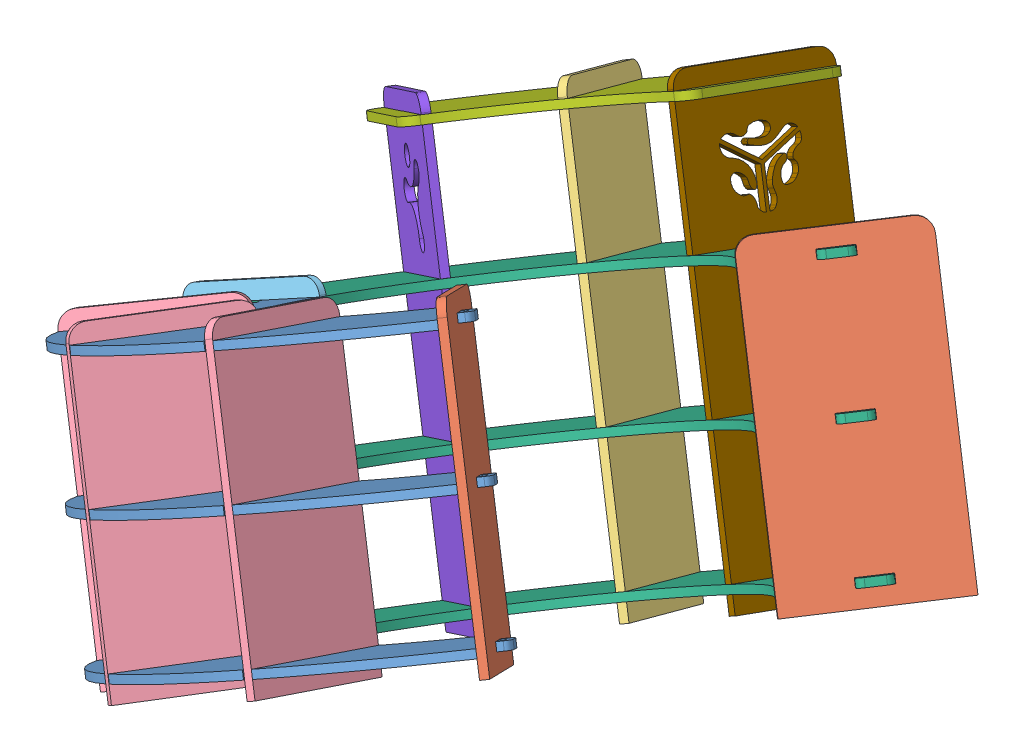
SolidWorks assembly Ensamblaje1Render.SLDASM, configuration Predeterminado (file format 10000). Lengths in mm.
Overall size (1967.4 1965.3 2323.95).
16 component instances, 9 part files, 47 mates.
Components (placement in the parent):
- 01 BaseParte2-1: 01 BaseParte2.SLDPRT [Predeterminado] at (-95.5965 5515.7388 -524.2059) x (0.888603 0.453154 -0.070968) z (-0.070968 0.288691 0.954789) size (1642.72 23 1000)
- 02 ExtremoAlto2-1: 02 ExtremoAlto2.SLDPRT [Predeterminado] at (483.5622 5313.2287 -1465.3669) x (-0.625547 -0.070132 0.777028) z (-0.635092 -0.532703 -0.559362) size (450 860 23)
- 01 BaseParte2-2: 01 BaseParte2.SLDPRT [Predeterminado] at (239.7374 4891.6292 -310.5747) x (0.888603 0.453154 -0.070968) z (-0.070968 0.288691 0.954789) size (1642.72 23 1000)
- 01 BaseParte2-3: 01 BaseParte2.SLDPRT [Predeterminado] at (72.0704 5203.684 -417.3903) x (0.888603 0.453154 -0.070968) z (-0.070968 0.288691 0.954789) size (1642.72 23 1000)
- 02 ExtremoAlto2-2: 02 ExtremoAlto2.SLDPRT [Predeterminado] at (384.6448 5643.9436 -343.9355) x (-0.516818 -0.512432 -0.685793) z (0.726327 0.161569 -0.668091) size (450 860 23)
- 03 ParedAlta-3: 03 ParedAlta.SLDPRT [Predeterminado] at (-211.6851 4656.7022 -1612.459) x (0.311221 0.453154 0.83534) z (0.453154 -0.843391 0.288691) size (450 23 1230)
- 03ParedBajaUnion-1: 03ParedBajaUnion.SLDPRT [Predeterminado] at (-369.3385 5296.5662 -185.0663) x (0.439858 -0.070132 -0.895325) z (0.775355 0.532703 0.339192) size (450 860 23)
- 03ParedBaja-3: 03ParedBaja.SLDPRT [Predeterminado] at (-716.6208 4911.2914 -834.7756) x (0.888603 0.453154 -0.070968) z (-0.070968 0.288691 0.954789) size (450 860 20)
- 03ParedBajaUnion-2: 03ParedBajaUnion.SLDPRT [Predeterminado] at (9.1704 5513.2982 -146.0381) x (-0.045625 -0.34537 -0.937357) z (0.890264 0.411595 -0.194986) size (450 860 23)
- 01 BaseParte1-4: 01 BaseParte1.SLDPRT [Predeterminado] at (296.3359 4646.6186 -1115.1989) x (0.888603 0.453154 -0.070968) z (-0.070968 0.288691 0.954789) size (1642.73 23 1060)
- 01 BaseParte1-5: 01 BaseParte1.SLDPRT [Predeterminado] at (128.669 4958.6734 -1222.0145) x (0.888603 0.453154 -0.070968) z (-0.070968 0.288691 0.954789) size (1642.73 23 1060)
- 01 BaseParte1-6: 01 BaseParte1.SLDPRT [Predeterminado] at (-38.998 5270.7283 -1328.8301) x (0.888603 0.453154 -0.070968) z (-0.070968 0.288691 0.954789) size (1642.73 23 1060)
- 01 BaseParte3-4: 01 BaseParte3.SLDPRT [Predeterminado] at (-207.9131 5582.3571 -1434.9311) x (0.888603 0.453154 -0.070968) z (-0.070968 0.288691 0.954789) size (1042.91 23 738.06)
- 03 ParedAlta logotipo-1: 03 ParedAlta logotipo.SLDPRT [Predeterminado] at (-593.0678 4573.6911 -1256.3197) x (0.711309 0.5373 0.453154) z (0.453154 -0.843391 0.288691) size (450 23 1230)
- 03 ParedAlta logotipo2-1: 03 ParedAlta logotipo2.SLDPRT [Predeterminado] at (258.228 4872.217 -1720.4626) x (-0.186347 0.227073 0.955883) z (0.453154 -0.843391 0.288691) size (450 23 1230)
- 03ParedBajaUnion-4: 03ParedBajaUnion.SLDPRT [Predeterminado] at (-634.7154 5066.9131 -439.4247) x (0.78783 0.227374 -0.572386) z (0.417104 0.486818 0.767484) size (450 860 23)
Mates (geometry in assembly coordinates):
- Coincidente28: coincident anti-aligned: plane of 01 BaseParte2-1 through (74.9008 5575.3819 -697.2598) normal (0.726327 0.161569 -0.668091); plane of 02 ExtremoAlto2-2 through (384.6448 5643.9436 -343.9355) normal (-0.726327 -0.161569 0.668091)
- Coincidente30: coincident anti-aligned: plane of 01 BaseParte2-1 through (96.6279 5736.0637 -261.9431) normal (-0.516818 -0.512432 -0.685793); plane of 02 ExtremoAlto2-2 through (377.8777 5624.3865 -390.4485) normal (0.516818 0.512432 0.685793)
- Coincidente49: coincident anti-aligned: plane of 01 BaseParte2-3 through (87.1221 5119.4552 -766.7554) normal (0.070968 -0.288691 -0.954789); plane of 01 BaseParte1-5 through (83.8951 5117.8096 -766.4977) normal (-0.070968 0.288691 0.954789)
- Coincidente50: coincident aligned: plane of 01 BaseParte2-3 through (61.6479 5223.082 -424.0302) normal (-0.453154 0.843391 -0.288691); plane of 01 BaseParte1-5 through (118.2464 4978.0714 -1228.6544) normal (-0.453154 0.843391 -0.288691)
- Coincidente51: coincident anti-aligned: plane of 01 BaseParte2-3 through (-686.0064 4841.8066 -364.3192) normal (0.888603 0.453154 -0.070968); plane of 01 BaseParte1-5 through (-626.1809 4598.4416 -1169.2011) normal (-0.888603 -0.453154 0.070968)
- Coincidente52: coincident aligned: plane of 01 BaseParte2-2 through (229.3148 4911.0272 -317.2146) normal (-0.453154 0.843391 -0.288691); plane of 01 BaseParte1-4 through (285.9134 4666.0166 -1121.8388) normal (-0.453154 0.843391 -0.288691)
- Coincidente53: coincident anti-aligned: plane of 01 BaseParte2-2 through (254.789 4807.4004 -659.9398) normal (0.070968 -0.288691 -0.954789); plane of 01 BaseParte1-4 through (251.5621 4805.7548 -659.6821) normal (-0.070968 0.288691 0.954789)
- Coincidente54: coincident anti-aligned: plane of 01 BaseParte2-2 through (-447.2512 4566.0041 -263.181) normal (-0.888603 -0.453154 0.070968); plane of 01 BaseParte1-4 through (-387.4257 4322.6391 -1068.0629) normal (0.888603 0.453154 -0.070968)
- Coincidente55: coincident aligned: plane of 01 BaseParte2-1 through (-106.0191 5535.1368 -530.8458) normal (-0.453154 0.843391 -0.288691); plane of 01 BaseParte1-6 through (-49.4205 5290.1263 -1335.47) normal (-0.453154 0.843391 -0.288691)
- Coincidente56: coincident anti-aligned: plane of 01 BaseParte2-1 through (-80.5449 5431.5101 -873.5711) normal (0.070968 -0.288691 -0.954789); plane of 01 BaseParte1-6 through (-83.7718 5429.8644 -873.3133) normal (-0.070968 0.288691 0.954789)
- Coincidente57: coincident anti-aligned: plane of 01 BaseParte2-1 through (-782.5851 5190.1137 -476.8122) normal (-0.888603 -0.453154 0.070968); plane of 01 BaseParte1-6 through (-722.7596 4946.7488 -1281.6941) normal (0.888603 0.453154 -0.070968)
- Coincidente60: coincident anti-aligned: plane of 03ParedBaja-3 through (-814.3702 5016.9795 -853.05) normal (0.888603 0.453154 -0.070968); plane of 01 BaseParte1-6 through (-793.8478 4910.4965 -1276.0167) normal (-0.888603 -0.453154 0.070968)
- Coincidente61: coincident anti-aligned: plane of 01 BaseParte2-2 through (410.2347 4951.2722 -483.6286) normal (0.726327 0.161569 -0.668091); plane of 02 ExtremoAlto2-2 through (384.6448 5643.9436 -343.9355) normal (-0.726327 -0.161569 0.668091)
- Coincidente63: coincident anti-aligned: plane of 01 BaseParte2-2 through (431.9618 5111.9541 -48.3118) normal (-0.516818 -0.512432 -0.685793); plane of 02 ExtremoAlto2-2 through (377.8777 5624.3865 -390.4485) normal (0.516818 0.512432 0.685793)
- Coincidente65: coincident anti-aligned: plane of 01 BaseParte2-3 through (310.8085 5470.1277 -93.406) normal (0.516818 0.512432 0.685793); plane of 02 ExtremoAlto2-2 through (424.3914 5670.5053 -328.7271) normal (-0.516818 -0.512432 -0.685793)
- Coincidente66: coincident anti-aligned: plane of 01 BaseParte2-3 through (242.5678 5263.3271 -590.4442) normal (0.726327 0.161569 -0.668091); plane of 02 ExtremoAlto2-2 through (384.6448 5643.9436 -343.9355) normal (-0.726327 -0.161569 0.668091)
- Coincidente67: coincident anti-aligned: plane of 02 ExtremoAlto2-1 through (468.9551 5300.9765 -1478.2322) normal (-0.635092 -0.532703 -0.559362); plane of 01 BaseParte1-6 through (112.6172 5426.0404 -1192.7542) normal (0.635092 0.532703 0.559362)
- Coincidente72: coincident anti-aligned: plane of 01 BaseParte1-4 through (285.9134 4666.0166 -1121.8388) normal (-0.453154 0.843391 -0.288691); plane of 03 ParedAlta logotipo2-1 through (369.674 4596.1625 -1457.3908) normal (0.453154 -0.843391 0.288691)
- Coincidente73: coincident anti-aligned: plane of 01 BaseParte1-5 through (118.2464 4978.0714 -1228.6544) normal (-0.453154 0.843391 -0.288691); plane of 03 ParedAlta logotipo2-1 through (202.0071 4908.2174 -1564.2064) normal (0.453154 -0.843391 0.288691)
- Coincidente74: coincident anti-aligned: plane of 01 BaseParte1-6 through (-49.4205 5290.1263 -1335.47) normal (-0.453154 0.843391 -0.288691); plane of 03 ParedAlta logotipo2-1 through (34.2093 5220.4317 -1670.3505) normal (0.453154 -0.843391 0.288691)
- Coincidente75: coincident anti-aligned: plane of 01 BaseParte3-4 through (-218.3357 5601.7551 -1441.5709) normal (-0.453154 0.843391 -0.288691); plane of 03 ParedAlta logotipo2-1 through (-133.4577 5532.4866 -1777.1661) normal (0.453154 -0.843391 0.288691)
- Coincidente80: coincident anti-aligned: plane of 03 ParedAlta-3 through (-518.5858 5359.6756 -1677.4921) normal (0.453154 -0.843391 0.288691); plane of 01 BaseParte3-4 through (-218.3357 5601.7551 -1441.5709) normal (-0.453154 0.843391 -0.288691)
- Coincidente82: coincident anti-aligned: plane of 01 BaseParte1-4 through (296.3359 4646.6186 -1115.1989) normal (0.453154 -0.843391 0.288691); plane of 03 ParedAlta logotipo-1 through (-432.1983 4251.2873 -1126.5637) normal (-0.453154 0.843391 -0.288691)
- Coincidente84: coincident anti-aligned: plane of 02 ExtremoAlto2-1 through (385.3306 5456.6149 -1531.5068) normal (0.453154 -0.843391 0.288691); plane of 01 BaseParte1-6 through (-49.4205 5290.1263 -1335.47) normal (-0.453154 0.843391 -0.288691)
- Coincidente85: coincident anti-aligned: plane of 01 BaseParte2-1 through (-106.0191 5535.1368 -530.8458) normal (-0.453154 0.843391 -0.288691); plane of 02 ExtremoAlto2-2 through (317.7258 5803.2982 -412.5762) normal (0.453154 -0.843391 0.288691)
- Coincidente91: coincident anti-aligned: plane of 01 BaseParte2-1 through (-95.5965 5515.7388 -524.2059) normal (0.453154 -0.843391 0.288691); plane of 03ParedBaja-3 through (-578.8904 5137.0653 -871.8565) normal (-0.453154 0.843391 -0.288691)
- Coincidente92: coincident anti-aligned: plane of 02 ExtremoAlto2-1 through (440.5444 5297.7913 -1442.9416) normal (0.625547 0.070132 -0.777028); plane of 01 BaseParte1-6 through (194.8822 5317.5157 -1638.9321) normal (-0.625547 -0.070132 0.777028)
- Coincidente93: coincident anti-aligned: plane of 01 BaseParte2-2 through (266.2861 4928.1201 -325.312) normal (-0.890264 -0.411595 0.194986); plane of 03ParedBajaUnion-2 through (-62.5999 5615.9963 -374.8984) normal (0.890264 0.411595 -0.194986)
- Coincidente95: coincident anti-aligned: plane of 01 BaseParte2-2 through (229.3148 4911.0272 -317.2146) normal (-0.453154 0.843391 -0.288691); plane of 03ParedBajaUnion-2 through (282.5326 5051.1013 8.4675) normal (0.453154 -0.843391 0.288691)
- Coincidente96: coincident anti-aligned: plane of 01 BaseParte2-2 through (245.5613 5034.0083 16.565) normal (0.045625 0.34537 0.937357); plane of 03ParedBajaUnion-2 through (292.9552 5031.7033 15.1074) normal (-0.045625 -0.34537 -0.937357)
- Coincidente97: coincident anti-aligned: plane of 01 BaseParte2-2 through (63.4139 4797.046 -389.7908) normal (0.775355 0.532703 0.339192); plane of 03ParedBajaUnion-1 through (-373.0668 5439.9816 -401.7782) normal (-0.775355 -0.532703 -0.339192)
- Coincidente98: coincident anti-aligned: plane of 01 BaseParte2-2 through (50.5795 4939.525 46.5981) normal (-0.439858 0.070132 0.895325); plane of 03ParedBajaUnion-1 through (-87.0657 4818.398 -11.5368) normal (0.439858 -0.070132 -0.895325)
- Coincidente99: coincident anti-aligned: plane of 01 BaseParte2-2 through (239.7374 4891.6292 -310.5747) normal (0.453154 -0.843391 0.288691); plane of 03ParedBajaUnion-1 through (11.9025 4802.6183 -212.9848) normal (-0.453154 0.843391 -0.288691)
- Coincidente110: coincident anti-aligned: plane of 01 BaseParte2-1 through (-556.8787 5405.0149 -203.2804) normal (-0.78783 -0.227374 0.572386); plane of 03ParedBajaUnion-4 through (-694.6522 5212.6519 -469.3254) normal (0.78783 0.227374 -0.572386)
- Coincidente113: coincident anti-aligned: plane of 01 BaseParte2-2 through (229.3148 4911.0272 -317.2146) normal (-0.453154 0.843391 -0.288691); plane of 03ParedBajaUnion-4 through (-370.2943 4607.7805 -261.932) normal (0.453154 -0.843391 0.288691)
- Bloquear1: lock: unknown of 01 BaseParte2-1; unknown of 03ParedBajaUnion-4
- Paralelo8: parallel: line of 01 BaseParte2-1 through (-892.6629 5168.8497 -366.1461) axis (0.453154 -0.843391 0.288691); plane of 03ParedBajaUnion-4 through (-574.9983 5264.5726 -597.2552) normal (-0.417104 -0.486818 -0.767484)
- Coincidente117: coincident anti-aligned: plane of 01 BaseParte2-1 through (-77.1384 5417.6529 -919.4009) normal (0.070968 -0.288691 -0.954789); plane of 03ParedBaja-3 through (-630.8861 5139.0232 -876.3132) normal (-0.070968 0.288691 0.954789)
- Coincidente118: coincident anti-aligned: plane of 01 BaseParte1-6 through (-254.5917 5290.1263 -1013.4158) normal (0.5373 0 -0.843391); plane of 03 ParedAlta logotipo-1 through (-605.4257 4573.6911 -1236.9217) normal (-0.5373 0 0.843391)
- Coincidente122: coincident anti-aligned: plane of 01 BaseParte1-6 through (16.0834 5210.3065 -1671.4788) normal (0.186347 -0.227073 -0.955883); plane of 03 ParedAlta logotipo2-1 through (44.6318 5201.0337 -1663.7106) normal (-0.186347 0.227073 0.955883)
- Coincidente123: coincident anti-aligned: plane of 01 BaseParte1-6 through (-31.2947 5300.2515 -1334.3417) normal (0.871738 0.486959 0.054264); plane of 03 ParedAlta logotipo2-1 through (-168.4552 5576.152 -1606.789) normal (-0.871738 -0.486959 -0.054264)
- Coincidente124: coincident anti-aligned: plane of 03 ParedAlta-3 through (-464.3706 5443.8768 -1528.7281) normal (-0.83534 -0.288691 0.46783); plane of 01 BaseParte1-6 through (-226.3674 5228.974 -1236.3714) normal (0.83534 0.288691 -0.46783)
- Coincidente125: coincident anti-aligned: plane of 03 ParedAlta-3 through (-340.4963 5028.2227 -1564.0366) normal (0.311221 0.453154 0.83534); plane of 01 BaseParte1-6 through (-173.972 5108.773 -1669.775) normal (-0.311221 -0.453154 -0.83534)
- Coincidente126: coincident anti-aligned: plane of 03 ParedAlta-3 through (-518.5858 5359.6756 -1677.4921) normal (0.453154 -0.843391 0.288691); plane of 01 BaseParte3-4 through (-218.3357 5601.7551 -1441.5709) normal (-0.453154 0.843391 -0.288691)
- Coincidente127: coincident anti-aligned: plane of 03 ParedAlta-3 through (-445.1578 5450.5167 -1539.4882) normal (0.83534 0.288691 -0.46783); plane of 01 BaseParte3-4 through (-374.8167 5547.6757 -1353.9342) normal (-0.83534 -0.288691 0.46783)
- Coincidente128: coincident anti-aligned: plane of 03 ParedAlta-3 through (-508.1632 5340.2776 -1670.8522) normal (0.311221 0.453154 0.83534); plane of 01 BaseParte3-4 through (-342.8919 5420.3948 -1775.8889) normal (-0.311221 -0.453154 -0.83534)
- Coincidente129: coincident anti-aligned: plane of 01 BaseParte3-4 through (-621.1252 5297.5011 -1698.1762) normal (-0.711309 -0.5373 -0.453154); plane of 03 ParedAlta logotipo-1 through (-485.4162 4664.3424 -1160.4672) normal (0.711309 0.5373 0.453154)
